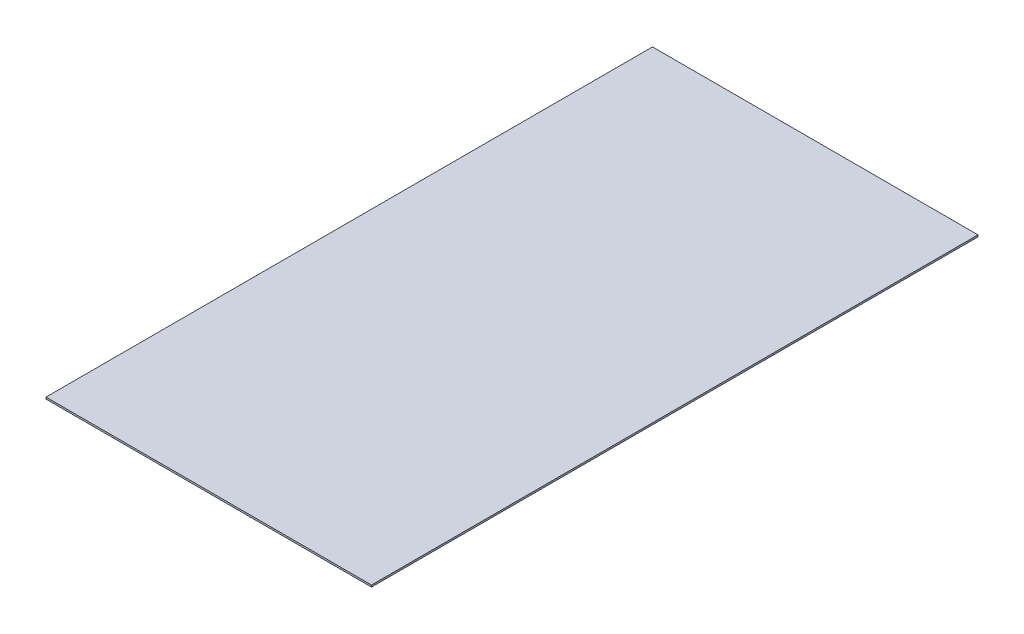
from build123d import *

# Parameters (mm, degrees)
SKETCH1_W           = 858.8375
SKETCH1_H           = 1600.2
BOSS_EXTRUDE1_DEPTH = 4.7625


with BuildPart() as part:
    # Sketch1 → Boss-Extrude1 (new body)
    with BuildSketch(Plane(origin=(0, 0, 0), x_dir=(1, 0, 0), z_dir=(0, 1, 0))):
        Rectangle(SKETCH1_W, SKETCH1_H)
    extrude(amount=BOSS_EXTRUDE1_DEPTH)


solid = part.part
